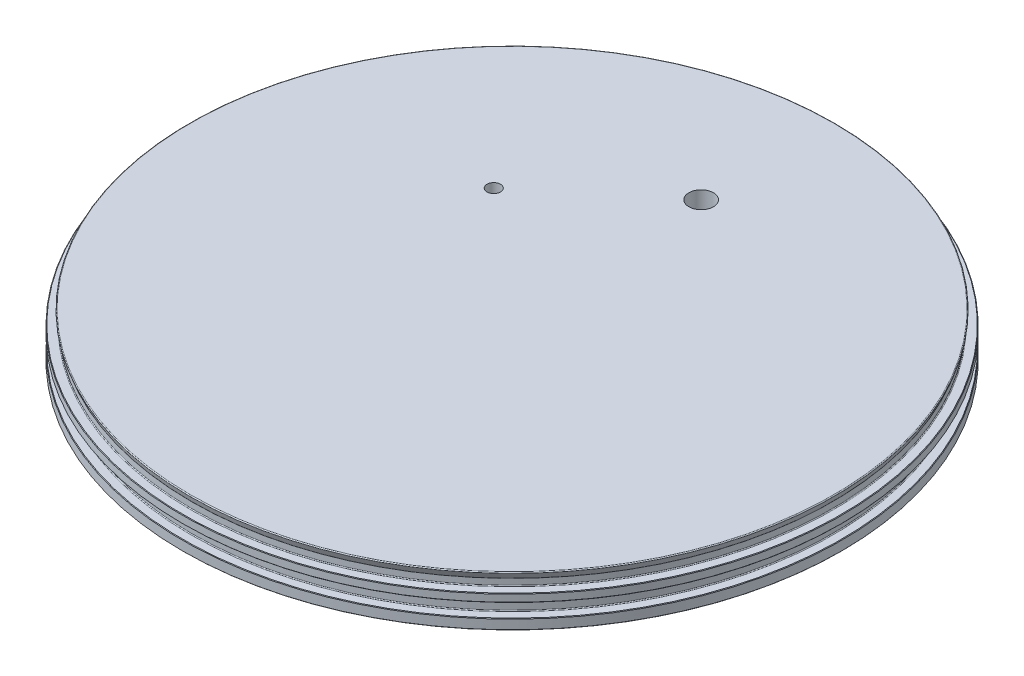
from build123d import *

# Parameters (mm, degrees)
FILLET1_R                   = 0.381
CHAMFER1_SIZE               = 0.254
CIRPATTERN1_COUNT           = 6
THRU_D                      = 11.50874
F_1_4_0_25_DIAMETER_HOLE2_D = 6.35


with BuildPart() as part:
    # Sketch1 → Revolve1 (revolve)
    with BuildSketch(Plane.XY, mode=Mode.PRIVATE) as revolve1_sk:
        Polygon((0, 0), (-124.46, 0), (-124.46, 10.414), (-154.94, 10.414), (-154.94, 15.24), (-150.622, 15.24), (-150.622, 21.59), (-154.94, 21.59), (-154.94, 25.4), (-150.622, 25.4), (-150.622, 28.575), (-151.777605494, 31.75), (0, 31.75), align=None)
    revolve(revolve1_sk.sketch.rotate(Axis((0, 0, 0), (0, 1, 0)), 270), axis=Axis((0, 0, 0), (0, 1, 0)))

    # Fillet1
    fillet1_edges = [part.edges().sort_by_distance(p)[0] for p in [
        (0, 25.4, 150.622),
        (0, 21.59, 150.622),
        (0, 15.24, 150.622),
        (0, 10.414, 124.46),
        (0, 31.75, 151.777605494),
        (0, 28.575, 150.622),
    ]]
    fillet(fillet1_edges, radius=FILLET1_R)

    # Chamfer1
    chamfer1_edges = [part.edges().sort_by_distance(p)[0] for p in [
        (0, 25.4, 154.94),
        (0, 21.59, 154.94),
        (0, 15.24, 154.94),
        (0, 10.414, 154.94),
    ]]
    chamfer(chamfer1_edges, length=CHAMFER1_SIZE)

    # Sketch4 → 1_4-20 Tapped Hole1 (revolve, cut)
    with BuildSketch(Plane(origin=(136.525, 10.414, 0), x_dir=(0, 0, -1), z_dir=(1, 0, 0))):
        Polygon((0, 0), (0, 11.693816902), (2.5527, 10.16), (2.5527, 0), align=None)
    f_1_4_20_tapped_hole1 = revolve(axis=Axis((136.525, 4.064, 0), (0, 1, 0)), mode=Mode.SUBTRACT)

    # CirPattern1: 1_4-20 Tapped Hole1 ×6 about axis
    cirpattern1_axis = Axis((0, 0, 0), (0, 1, 0))
    for i in range(1, CIRPATTERN1_COUNT):
        add(f_1_4_20_tapped_hole1.rotate(cirpattern1_axis, i * 360 / CIRPATTERN1_COUNT), mode=Mode.SUBTRACT)

    # thru (through all)
    with Locations(Plane(origin=(0, 31.75, 0), x_dir=(-1, 0, 0), z_dir=(0, 1, 0))):
        with Locations((0, -88.9)):
            Hole(THRU_D / 2)

    # Sketch31 → SAE_4 (revolve, cut)
    with BuildSketch(Plane(origin=(-53.508204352, 0, -44.898714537), x_dir=(0, 0, -1), z_dir=(1, 0, 0))):
        Polygon((0, 0), (0, 18.034), (4.96062, 18.034), (4.96062, 3.08437889), (5.68279889, 2.3622), (6.1849, 0), align=None)
    revolve(axis=Axis((-53.508204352, -6.445314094, -44.898714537), (0, 1, 0)), mode=Mode.SUBTRACT)

    # 1_4 _0.25_ Diameter Hole2 (through all)
    with Locations(Plane.XZ):
        with Locations((-53.508204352, -44.898714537)):
            Hole(F_1_4_0_25_DIAMETER_HOLE2_D / 2)


solid = part.part
